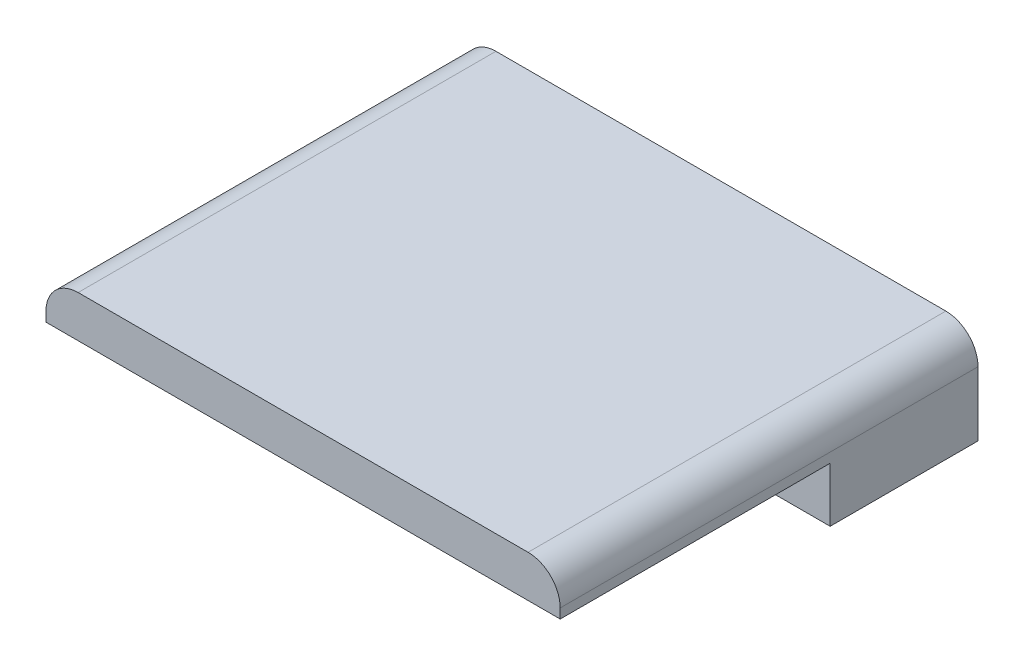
from build123d import *

# Parameters (mm, degrees)
SKIZZE1_W                       = 80
SKIZZE1_H                       = 15
LINEAR_AUSTRAGEN1_DEPTH         = 65
SKIZZE2_W                       = 42
SKIZZE2_H                       = 8.5
SCHNITT_LINEAR_AUSTRAGEN1_DEPTH = 105.16333328
VERRUNDUNG1_R                   = 5


with BuildPart() as part:
    # Skizze1 → Linear austragen1 (new body)
    with BuildSketch(Plane.XY):
        with Locations((0, 7.5)):
            Rectangle(SKIZZE1_W, SKIZZE1_H)
    extrude(amount=LINEAR_AUSTRAGEN1_DEPTH)

    # Skizze2 → Schnitt-Linear austragen1 (cut, through all)
    with BuildSketch(Plane(origin=(40, 0, 0), x_dir=(0, 0, -1), z_dir=(1, 0, 0))):
        with Locations((-44, 4.25)):
            Rectangle(SKIZZE2_W, SKIZZE2_H)
    extrude(amount=-SCHNITT_LINEAR_AUSTRAGEN1_DEPTH, mode=Mode.SUBTRACT)

    # Verrundung1
    verrundung1_edges = [part.edges().sort_by_distance(p)[0] for p in [
        (40, 15, 32.5),
        (-40, 15, 32.5),
    ]]
    fillet(verrundung1_edges, radius=VERRUNDUNG1_R)


solid = part.part
